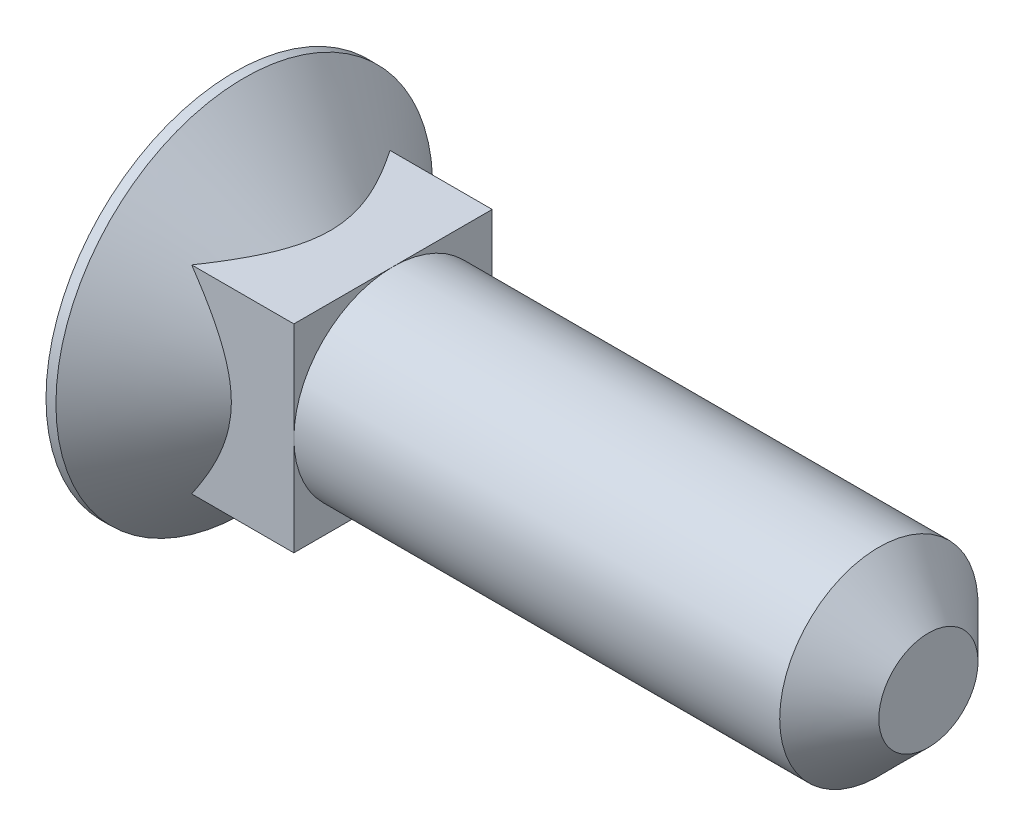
from build123d import *

# Parameters (mm, degrees)
SQUARESKE_W  = 10
SQUARESKE_H  = 10
SQUARE_DEPTH = 8


with BuildPart() as part:
    # BodySke → BaseBody (revolve)
    with BuildSketch(Plane.XY, mode=Mode.PRIVATE) as basebody_sk:
        Polygon((0, 0), (0, 9.5), (0.5, 9.5), (4.845599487, 5), (32.5, 5), (35, 2.5), (35, 0), align=None)
    revolve(basebody_sk.sketch.rotate(Axis((0, 0, 0), (1, 0, 0)), 90), axis=Axis((0, 0, 0), (1, 0, 0)))

    # SquareSke → Square (add)
    with BuildSketch(Plane(origin=(0, 0, 0), x_dir=(0, 0, -1), z_dir=(1, 0, 0))):
        Rectangle(SQUARESKE_W, SQUARESKE_H)
    extrude(amount=SQUARE_DEPTH)


solid = part.part
